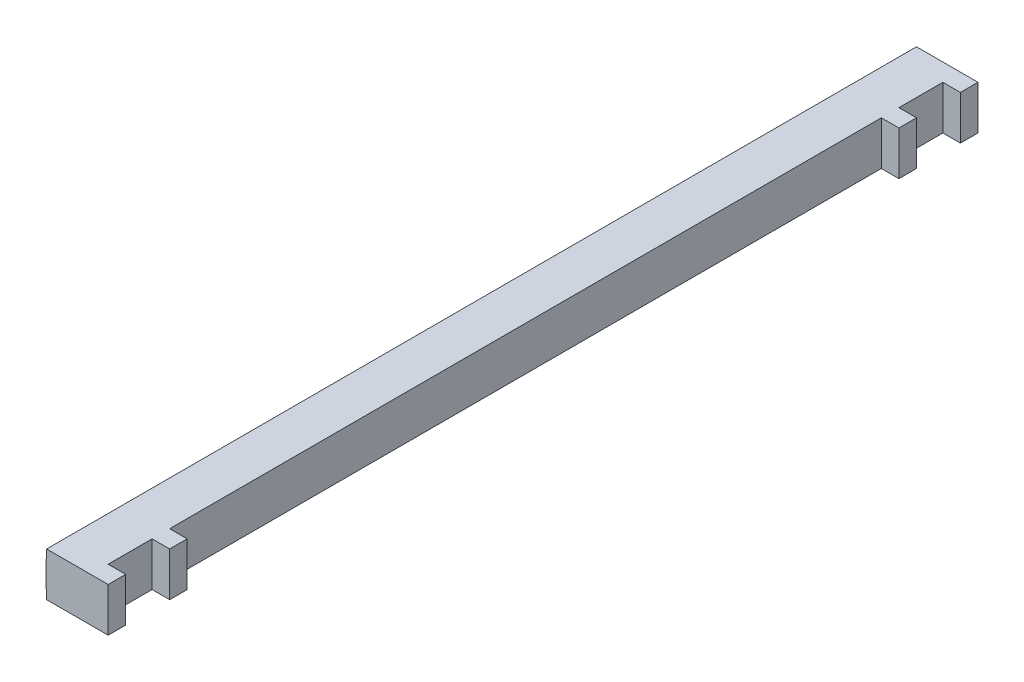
ISO-10303-21;
HEADER;
FILE_DESCRIPTION(('STEP AP214'),'2;1');
FILE_NAME('part.step','',(''),(''),'','','');
FILE_SCHEMA(('AUTOMOTIVE_DESIGN { 1 0 10303 214 1 1 1 1 }'));
ENDSEC;
DATA;
#1=APPLICATION_CONTEXT('core data for automotive mechanical design processes');
#2=APPLICATION_PROTOCOL_DEFINITION('international standard','automotive_design',2000,#1);
#3=PRODUCT_CONTEXT('',#1,'mechanical');
#4=PRODUCT('Part','Part','',(#3));
#5=PRODUCT_RELATED_PRODUCT_CATEGORY('part','',(#4));
#6=PRODUCT_DEFINITION_FORMATION('','',#4);
#7=PRODUCT_DEFINITION_CONTEXT('part definition',#1,'design');
#8=PRODUCT_DEFINITION('design','',#6,#7);
#9=PRODUCT_DEFINITION_SHAPE('','',#8);
#10=(LENGTH_UNIT() NAMED_UNIT(*) SI_UNIT(.MILLI.,.METRE.));
#11=(NAMED_UNIT(*) PLANE_ANGLE_UNIT() SI_UNIT($,.RADIAN.));
#12=(NAMED_UNIT(*) SI_UNIT($,.STERADIAN.) SOLID_ANGLE_UNIT());
#13=UNCERTAINTY_MEASURE_WITH_UNIT(LENGTH_MEASURE(1.E-05),#10,'distance_accuracy_value','');
#14=(GEOMETRIC_REPRESENTATION_CONTEXT(3) GLOBAL_UNCERTAINTY_ASSIGNED_CONTEXT((#13)) GLOBAL_UNIT_ASSIGNED_CONTEXT((#10,
#11,#12)) REPRESENTATION_CONTEXT('',''));
#15=CARTESIAN_POINT('',(0.,0.,0.));
#16=DIRECTION('',(0.,0.,1.));
#17=DIRECTION('',(1.,0.,0.));
#18=AXIS2_PLACEMENT_3D('',#15,#16,#17);
#19=CARTESIAN_POINT('',(-41.169048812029,3.175,173.99));
#20=DIRECTION('',(-1.,0.,0.));
#21=DIRECTION('',(0.,0.,1.));
#22=AXIS2_PLACEMENT_3D('',#19,#20,#21);
#23=PLANE('',#22);
#24=DIRECTION('',(0.,-1.,0.));
#25=VECTOR('',#24,1.);
#26=CARTESIAN_POINT('',(-41.169048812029,3.175,2.54000000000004));
#27=LINE('',#26,#25);
#28=CARTESIAN_POINT('',(-41.169048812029,3.175,2.54000000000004));
#29=VERTEX_POINT('',#28);
#30=CARTESIAN_POINT('',(-41.169048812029,-3.175,2.54000000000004));
#31=VERTEX_POINT('',#30);
#32=EDGE_CURVE('E62',#29,#31,#27,.T.);
#33=ORIENTED_EDGE('',*,*,#32,.F.);
#34=DIRECTION('',(0.,0.,-1.));
#35=VECTOR('',#34,1.);
#36=CARTESIAN_POINT('',(-41.169048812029,3.175,173.99));
#37=LINE('',#36,#35);
#38=CARTESIAN_POINT('',(-41.169048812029,3.175,8.89000000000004));
#39=VERTEX_POINT('',#38);
#40=EDGE_CURVE('E200',#39,#29,#37,.T.);
#41=ORIENTED_EDGE('',*,*,#40,.F.);
#42=DIRECTION('',(0.,1.,0.));
#43=VECTOR('',#42,1.);
#44=CARTESIAN_POINT('',(-41.169048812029,-3.175,8.89000000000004));
#45=LINE('',#44,#43);
#46=CARTESIAN_POINT('',(-41.169048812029,-3.175,8.89000000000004));
#47=VERTEX_POINT('',#46);
#48=EDGE_CURVE('E291',#47,#39,#45,.T.);
#49=ORIENTED_EDGE('',*,*,#48,.F.);
#50=DIRECTION('',(0.,0.,-1.));
#51=VECTOR('',#50,1.);
#52=CARTESIAN_POINT('',(-41.169048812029,-3.175,173.99));
#53=LINE('',#52,#51);
#54=EDGE_CURVE('E58',#47,#31,#53,.T.);
#55=ORIENTED_EDGE('',*,*,#54,.T.);
#56=EDGE_LOOP('',(#33,#41,#49,#55));
#57=FACE_BOUND('',#56,.T.);
#58=ADVANCED_FACE('F42',(#57),#23,.F.);
#59=DIRECTION('',(0.,-1.,0.));
#60=VECTOR('',#59,1.);
#61=CARTESIAN_POINT('',(-41.169048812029,3.175,116.84));
#62=LINE('',#61,#60);
#63=CARTESIAN_POINT('',(-41.169048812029,3.175,116.84));
#64=VERTEX_POINT('',#63);
#65=CARTESIAN_POINT('',(-41.169048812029,-3.175,116.84));
#66=VERTEX_POINT('',#65);
#67=EDGE_CURVE('E216',#64,#66,#62,.T.);
#68=ORIENTED_EDGE('',*,*,#67,.F.);
#69=CARTESIAN_POINT('',(-41.169048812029,3.175,123.19));
#70=VERTEX_POINT('',#69);
#71=EDGE_CURVE('E203',#70,#64,#37,.T.);
#72=ORIENTED_EDGE('',*,*,#71,.F.);
#73=DIRECTION('',(0.,1.,0.));
#74=VECTOR('',#73,1.);
#75=CARTESIAN_POINT('',(-41.169048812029,-3.175,123.19));
#76=LINE('',#75,#74);
#77=CARTESIAN_POINT('',(-41.169048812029,-3.175,123.19));
#78=VERTEX_POINT('',#77);
#79=EDGE_CURVE('E218',#78,#70,#76,.T.);
#80=ORIENTED_EDGE('',*,*,#79,.F.);
#81=EDGE_CURVE('E51',#78,#66,#53,.T.);
#82=ORIENTED_EDGE('',*,*,#81,.T.);
#83=EDGE_LOOP('',(#68,#72,#80,#82));
#84=FACE_BOUND('',#83,.T.);
#85=ADVANCED_FACE('F215',(#84),#23,.F.);
#86=CARTESIAN_POINT('',(-41.169048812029,-3.175,114.3));
#87=VERTEX_POINT('',#86);
#88=CARTESIAN_POINT('',(-41.169048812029,-3.175,11.43));
#89=VERTEX_POINT('',#88);
#90=EDGE_CURVE('E205',#87,#89,#53,.T.);
#91=ORIENTED_EDGE('',*,*,#90,.T.);
#92=DIRECTION('',(0.,1.,0.));
#93=VECTOR('',#92,1.);
#94=CARTESIAN_POINT('',(-41.169048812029,-3.175,11.43));
#95=LINE('',#94,#93);
#96=CARTESIAN_POINT('',(-41.169048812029,3.175,11.43));
#97=VERTEX_POINT('',#96);
#98=EDGE_CURVE('E287',#89,#97,#95,.T.);
#99=ORIENTED_EDGE('',*,*,#98,.T.);
#100=CARTESIAN_POINT('',(-41.169048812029,3.175,114.3));
#101=VERTEX_POINT('',#100);
#102=EDGE_CURVE('E202',#101,#97,#37,.T.);
#103=ORIENTED_EDGE('',*,*,#102,.F.);
#104=DIRECTION('',(0.,-1.,0.));
#105=VECTOR('',#104,1.);
#106=CARTESIAN_POINT('',(-41.169048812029,3.175,114.3));
#107=LINE('',#106,#105);
#108=EDGE_CURVE('E238',#101,#87,#107,.T.);
#109=ORIENTED_EDGE('',*,*,#108,.T.);
#110=EDGE_LOOP('',(#91,#99,#103,#109));
#111=FACE_BOUND('',#110,.T.);
#112=ADVANCED_FACE('F346',(#111),#23,.F.);
#113=CARTESIAN_POINT('',(0.,0.,173.99));
#114=DIRECTION('',(0.,0.,-1.));
#115=DIRECTION('',(-1.,0.,0.));
#116=AXIS2_PLACEMENT_3D('',#113,#114,#115);
#117=CYLINDRICAL_SURFACE('',#116,47.625);
#118=DIRECTION('',(0.,0.,-1.));
#119=VECTOR('',#118,1.);
#120=CARTESIAN_POINT('',(-47.519048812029,-3.175,173.99));
#121=LINE('',#120,#119);
#122=CARTESIAN_POINT('',(-47.519048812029,-3.175,125.73));
#123=VERTEX_POINT('',#122);
#124=CARTESIAN_POINT('',(-47.519048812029,-3.175,0.));
#125=VERTEX_POINT('',#124);
#126=EDGE_CURVE('E11',#123,#125,#121,.T.);
#127=ORIENTED_EDGE('',*,*,#126,.F.);
#128=CARTESIAN_POINT('',(0.,0.,125.73));
#129=DIRECTION('',(0.,0.,-1.));
#130=DIRECTION('',(-1.,0.,0.));
#131=AXIS2_PLACEMENT_3D('',#128,#129,#130);
#132=CIRCLE('',#131,47.625);
#133=CARTESIAN_POINT('',(-47.519048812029,3.175,125.73));
#134=VERTEX_POINT('',#133);
#135=EDGE_CURVE('E170',#123,#134,#132,.T.);
#136=ORIENTED_EDGE('',*,*,#135,.T.);
#137=DIRECTION('',(0.,0.,-1.));
#138=VECTOR('',#137,1.);
#139=CARTESIAN_POINT('',(-47.519048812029,3.175,173.99));
#140=LINE('',#139,#138);
#141=CARTESIAN_POINT('',(-47.519048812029,3.175,0.));
#142=VERTEX_POINT('',#141);
#143=EDGE_CURVE('E180',#134,#142,#140,.T.);
#144=ORIENTED_EDGE('',*,*,#143,.T.);
#145=CARTESIAN_POINT('',(0.,0.,0.));
#146=DIRECTION('',(0.,0.,1.));
#147=DIRECTION('',(1.,0.,0.));
#148=AXIS2_PLACEMENT_3D('',#145,#146,#147);
#149=CIRCLE('',#148,47.625);
#150=EDGE_CURVE('E179',#142,#125,#149,.T.);
#151=ORIENTED_EDGE('',*,*,#150,.T.);
#152=EDGE_LOOP('',(#127,#136,#144,#151));
#153=FACE_BOUND('',#152,.T.);
#154=ADVANCED_FACE('F44',(#153),#117,.T.);
#155=CARTESIAN_POINT('',(-41.169048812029,-3.175,173.99));
#156=DIRECTION('',(0.,1.,0.));
#157=DIRECTION('',(0.,0.,1.));
#158=AXIS2_PLACEMENT_3D('',#155,#156,#157);
#159=PLANE('',#158);
#160=DIRECTION('',(-1.,0.,0.));
#161=VECTOR('',#160,1.);
#162=CARTESIAN_POINT('',(-38.629048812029,-3.175,125.73));
#163=LINE('',#162,#161);
#164=CARTESIAN_POINT('',(-38.629048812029,-3.175,125.73));
#165=VERTEX_POINT('',#164);
#166=EDGE_CURVE('E154',#165,#123,#163,.T.);
#167=ORIENTED_EDGE('',*,*,#166,.T.);
#168=ORIENTED_EDGE('',*,*,#126,.T.);
#169=DIRECTION('',(1.,0.,0.));
#170=VECTOR('',#169,1.);
#171=CARTESIAN_POINT('',(-41.169048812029,-3.175,0.));
#172=LINE('',#171,#170);
#173=CARTESIAN_POINT('',(-38.629048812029,-3.175,0.));
#174=VERTEX_POINT('',#173);
#175=EDGE_CURVE('E184',#125,#174,#172,.T.);
#176=ORIENTED_EDGE('',*,*,#175,.T.);
#177=DIRECTION('',(0.,0.,-1.));
#178=VECTOR('',#177,1.);
#179=CARTESIAN_POINT('',(-38.629048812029,-3.175,2.54000000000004));
#180=LINE('',#179,#178);
#181=CARTESIAN_POINT('',(-38.629048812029,-3.175,2.54000000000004));
#182=VERTEX_POINT('',#181);
#183=EDGE_CURVE('E263',#182,#174,#180,.T.);
#184=ORIENTED_EDGE('',*,*,#183,.F.);
#185=DIRECTION('',(-1.,0.,0.));
#186=VECTOR('',#185,1.);
#187=CARTESIAN_POINT('',(-38.629048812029,-3.175,2.54000000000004));
#188=LINE('',#187,#186);
#189=EDGE_CURVE('E571',#182,#31,#188,.T.);
#190=ORIENTED_EDGE('',*,*,#189,.T.);
#191=ORIENTED_EDGE('',*,*,#54,.F.);
#192=DIRECTION('',(-1.,0.,0.));
#193=VECTOR('',#192,1.);
#194=CARTESIAN_POINT('',(-38.629048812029,-3.175,8.89000000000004));
#195=LINE('',#194,#193);
#196=CARTESIAN_POINT('',(-38.629048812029,-3.175,8.89000000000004));
#197=VERTEX_POINT('',#196);
#198=EDGE_CURVE('E273',#197,#47,#195,.T.);
#199=ORIENTED_EDGE('',*,*,#198,.F.);
#200=DIRECTION('',(0.,0.,-1.));
#201=VECTOR('',#200,1.);
#202=CARTESIAN_POINT('',(-38.629048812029,-3.175,11.43));
#203=LINE('',#202,#201);
#204=CARTESIAN_POINT('',(-38.629048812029,-3.175,11.43));
#205=VERTEX_POINT('',#204);
#206=EDGE_CURVE('E292',#205,#197,#203,.T.);
#207=ORIENTED_EDGE('',*,*,#206,.F.);
#208=DIRECTION('',(-1.,0.,0.));
#209=VECTOR('',#208,1.);
#210=CARTESIAN_POINT('',(-38.629048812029,-3.175,11.43));
#211=LINE('',#210,#209);
#212=EDGE_CURVE('E283',#205,#89,#211,.T.);
#213=ORIENTED_EDGE('',*,*,#212,.T.);
#214=ORIENTED_EDGE('',*,*,#90,.F.);
#215=DIRECTION('',(-1.,0.,0.));
#216=VECTOR('',#215,1.);
#217=CARTESIAN_POINT('',(-38.629048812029,-3.175,114.3));
#218=LINE('',#217,#216);
#219=CARTESIAN_POINT('',(-38.629048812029,-3.175,114.3));
#220=VERTEX_POINT('',#219);
#221=EDGE_CURVE('E295',#220,#87,#218,.T.);
#222=ORIENTED_EDGE('',*,*,#221,.F.);
#223=DIRECTION('',(0.,0.,-1.));
#224=VECTOR('',#223,1.);
#225=CARTESIAN_POINT('',(-38.629048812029,-3.175,116.84));
#226=LINE('',#225,#224);
#227=CARTESIAN_POINT('',(-38.629048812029,-3.175,116.84));
#228=VERTEX_POINT('',#227);
#229=EDGE_CURVE('E241',#228,#220,#226,.T.);
#230=ORIENTED_EDGE('',*,*,#229,.F.);
#231=DIRECTION('',(-1.,0.,0.));
#232=VECTOR('',#231,1.);
#233=CARTESIAN_POINT('',(-38.629048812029,-3.175,116.84));
#234=LINE('',#233,#232);
#235=EDGE_CURVE('E222',#228,#66,#234,.T.);
#236=ORIENTED_EDGE('',*,*,#235,.T.);
#237=ORIENTED_EDGE('',*,*,#81,.F.);
#238=DIRECTION('',(-1.,0.,0.));
#239=VECTOR('',#238,1.);
#240=CARTESIAN_POINT('',(-38.629048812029,-3.175,123.19));
#241=LINE('',#240,#239);
#242=CARTESIAN_POINT('',(-38.629048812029,-3.175,123.19));
#243=VERTEX_POINT('',#242);
#244=EDGE_CURVE('E185',#243,#78,#241,.T.);
#245=ORIENTED_EDGE('',*,*,#244,.F.);
#246=DIRECTION('',(0.,0.,-1.));
#247=VECTOR('',#246,1.);
#248=CARTESIAN_POINT('',(-38.629048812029,-3.175,125.73));
#249=LINE('',#248,#247);
#250=EDGE_CURVE('E161',#165,#243,#249,.T.);
#251=ORIENTED_EDGE('',*,*,#250,.F.);
#252=EDGE_LOOP('',(#167,#168,#176,#184,#190,#191,#199,#207,#213,#214,#222,#230,#236,#237,#245,#251));
#253=FACE_BOUND('',#252,.T.);
#254=ADVANCED_FACE('F156',(#253),#159,.F.);
#255=CARTESIAN_POINT('',(-47.519048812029,3.175,173.99));
#256=DIRECTION('',(0.,-1.,0.));
#257=DIRECTION('',(0.,0.,-1.));
#258=AXIS2_PLACEMENT_3D('',#255,#256,#257);
#259=PLANE('',#258);
#260=ORIENTED_EDGE('',*,*,#143,.F.);
#261=DIRECTION('',(-1.,0.,0.));
#262=VECTOR('',#261,1.);
#263=CARTESIAN_POINT('',(-38.629048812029,3.175,125.73));
#264=LINE('',#263,#262);
#265=CARTESIAN_POINT('',(-38.629048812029,3.175,125.73));
#266=VERTEX_POINT('',#265);
#267=EDGE_CURVE('E166',#266,#134,#264,.T.);
#268=ORIENTED_EDGE('',*,*,#267,.F.);
#269=DIRECTION('',(0.,0.,-1.));
#270=VECTOR('',#269,1.);
#271=CARTESIAN_POINT('',(-38.629048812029,3.175,125.73));
#272=LINE('',#271,#270);
#273=CARTESIAN_POINT('',(-38.629048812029,3.175,123.19));
#274=VERTEX_POINT('',#273);
#275=EDGE_CURVE('E232',#266,#274,#272,.T.);
#276=ORIENTED_EDGE('',*,*,#275,.T.);
#277=DIRECTION('',(-1.,0.,0.));
#278=VECTOR('',#277,1.);
#279=CARTESIAN_POINT('',(-38.629048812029,3.175,123.19));
#280=LINE('',#279,#278);
#281=EDGE_CURVE('E192',#274,#70,#280,.T.);
#282=ORIENTED_EDGE('',*,*,#281,.T.);
#283=ORIENTED_EDGE('',*,*,#71,.T.);
#284=DIRECTION('',(-1.,0.,0.));
#285=VECTOR('',#284,1.);
#286=CARTESIAN_POINT('',(-38.629048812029,3.175,116.84));
#287=LINE('',#286,#285);
#288=CARTESIAN_POINT('',(-38.629048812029,3.175,116.84));
#289=VERTEX_POINT('',#288);
#290=EDGE_CURVE('E315',#289,#64,#287,.T.);
#291=ORIENTED_EDGE('',*,*,#290,.F.);
#292=DIRECTION('',(0.,0.,-1.));
#293=VECTOR('',#292,1.);
#294=CARTESIAN_POINT('',(-38.629048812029,3.175,116.84));
#295=LINE('',#294,#293);
#296=CARTESIAN_POINT('',(-38.629048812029,3.175,114.3));
#297=VERTEX_POINT('',#296);
#298=EDGE_CURVE('E328',#289,#297,#295,.T.);
#299=ORIENTED_EDGE('',*,*,#298,.T.);
#300=DIRECTION('',(-1.,0.,0.));
#301=VECTOR('',#300,1.);
#302=CARTESIAN_POINT('',(-38.629048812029,3.175,114.3));
#303=LINE('',#302,#301);
#304=EDGE_CURVE('E311',#297,#101,#303,.T.);
#305=ORIENTED_EDGE('',*,*,#304,.T.);
#306=ORIENTED_EDGE('',*,*,#102,.T.);
#307=DIRECTION('',(-1.,0.,0.));
#308=VECTOR('',#307,1.);
#309=CARTESIAN_POINT('',(-38.629048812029,3.175,11.43));
#310=LINE('',#309,#308);
#311=CARTESIAN_POINT('',(-38.629048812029,3.175,11.43));
#312=VERTEX_POINT('',#311);
#313=EDGE_CURVE('E280',#312,#97,#310,.T.);
#314=ORIENTED_EDGE('',*,*,#313,.F.);
#315=DIRECTION('',(0.,0.,-1.));
#316=VECTOR('',#315,1.);
#317=CARTESIAN_POINT('',(-38.629048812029,3.175,11.43));
#318=LINE('',#317,#316);
#319=CARTESIAN_POINT('',(-38.629048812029,3.175,8.89000000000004));
#320=VERTEX_POINT('',#319);
#321=EDGE_CURVE('E299',#312,#320,#318,.T.);
#322=ORIENTED_EDGE('',*,*,#321,.T.);
#323=DIRECTION('',(-1.,0.,0.));
#324=VECTOR('',#323,1.);
#325=CARTESIAN_POINT('',(-38.629048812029,3.175,8.89000000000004));
#326=LINE('',#325,#324);
#327=EDGE_CURVE('E276',#320,#39,#326,.T.);
#328=ORIENTED_EDGE('',*,*,#327,.T.);
#329=ORIENTED_EDGE('',*,*,#40,.T.);
#330=DIRECTION('',(-1.,0.,0.));
#331=VECTOR('',#330,1.);
#332=CARTESIAN_POINT('',(-38.629048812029,3.175,2.54000000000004));
#333=LINE('',#332,#331);
#334=CARTESIAN_POINT('',(-38.629048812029,3.175,2.54000000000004));
#335=VERTEX_POINT('',#334);
#336=EDGE_CURVE('E175',#335,#29,#333,.T.);
#337=ORIENTED_EDGE('',*,*,#336,.F.);
#338=DIRECTION('',(0.,0.,-1.));
#339=VECTOR('',#338,1.);
#340=CARTESIAN_POINT('',(-38.629048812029,3.175,2.54000000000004));
#341=LINE('',#340,#339);
#342=CARTESIAN_POINT('',(-38.629048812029,3.175,0.));
#343=VERTEX_POINT('',#342);
#344=EDGE_CURVE('E254',#335,#343,#341,.T.);
#345=ORIENTED_EDGE('',*,*,#344,.T.);
#346=DIRECTION('',(-1.,0.,0.));
#347=VECTOR('',#346,1.);
#348=CARTESIAN_POINT('',(-47.519048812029,3.175,0.));
#349=LINE('',#348,#347);
#350=EDGE_CURVE('E189',#343,#142,#349,.T.);
#351=ORIENTED_EDGE('',*,*,#350,.T.);
#352=EDGE_LOOP('',(#260,#268,#276,#282,#283,#291,#299,#305,#306,#314,#322,#328,#329,#337,#345,#351));
#353=FACE_BOUND('',#352,.T.);
#354=ADVANCED_FACE('F251',(#353),#259,.F.);
#355=CARTESIAN_POINT('',(0.,0.,0.));
#356=DIRECTION('',(0.,0.,1.));
#357=DIRECTION('',(1.,0.,0.));
#358=AXIS2_PLACEMENT_3D('',#355,#356,#357);
#359=PLANE('',#358);
#360=ORIENTED_EDGE('',*,*,#150,.F.);
#361=ORIENTED_EDGE('',*,*,#350,.F.);
#362=DIRECTION('',(0.,-1.,0.));
#363=VECTOR('',#362,1.);
#364=CARTESIAN_POINT('',(-38.629048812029,3.175,0.));
#365=LINE('',#364,#363);
#366=EDGE_CURVE('E258',#343,#174,#365,.T.);
#367=ORIENTED_EDGE('',*,*,#366,.T.);
#368=ORIENTED_EDGE('',*,*,#175,.F.);
#369=EDGE_LOOP('',(#360,#361,#367,#368));
#370=FACE_BOUND('',#369,.T.);
#371=ADVANCED_FACE('F257',(#370),#359,.F.);
#372=CARTESIAN_POINT('',(-38.629048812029,-3.175,123.19));
#373=DIRECTION('',(0.,0.,1.));
#374=DIRECTION('',(1.,0.,0.));
#375=AXIS2_PLACEMENT_3D('',#372,#373,#374);
#376=PLANE('',#375);
#377=ORIENTED_EDGE('',*,*,#79,.T.);
#378=ORIENTED_EDGE('',*,*,#281,.F.);
#379=DIRECTION('',(0.,1.,0.));
#380=VECTOR('',#379,1.);
#381=CARTESIAN_POINT('',(-38.629048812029,-3.175,123.19));
#382=LINE('',#381,#380);
#383=EDGE_CURVE('E226',#243,#274,#382,.T.);
#384=ORIENTED_EDGE('',*,*,#383,.F.);
#385=ORIENTED_EDGE('',*,*,#244,.T.);
#386=EDGE_LOOP('',(#377,#378,#384,#385));
#387=FACE_BOUND('',#386,.T.);
#388=ADVANCED_FACE('F224',(#387),#376,.F.);
#389=CARTESIAN_POINT('',(-38.629048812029,-3.175,125.73));
#390=DIRECTION('',(0.,0.,1.));
#391=DIRECTION('',(1.,0.,0.));
#392=AXIS2_PLACEMENT_3D('',#389,#390,#391);
#393=PLANE('',#392);
#394=ORIENTED_EDGE('',*,*,#267,.T.);
#395=ORIENTED_EDGE('',*,*,#135,.F.);
#396=ORIENTED_EDGE('',*,*,#166,.F.);
#397=DIRECTION('',(0.,1.,0.));
#398=VECTOR('',#397,1.);
#399=CARTESIAN_POINT('',(-38.629048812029,-3.175,125.73));
#400=LINE('',#399,#398);
#401=EDGE_CURVE('E167',#165,#266,#400,.T.);
#402=ORIENTED_EDGE('',*,*,#401,.T.);
#403=EDGE_LOOP('',(#394,#395,#396,#402));
#404=FACE_BOUND('',#403,.T.);
#405=ADVANCED_FACE('F171',(#404),#393,.T.);
#406=CARTESIAN_POINT('',(-38.629048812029,0.,0.));
#407=DIRECTION('',(1.,0.,0.));
#408=DIRECTION('',(0.,0.,-1.));
#409=AXIS2_PLACEMENT_3D('',#406,#407,#408);
#410=PLANE('',#409);
#411=ORIENTED_EDGE('',*,*,#250,.T.);
#412=ORIENTED_EDGE('',*,*,#383,.T.);
#413=ORIENTED_EDGE('',*,*,#275,.F.);
#414=ORIENTED_EDGE('',*,*,#401,.F.);
#415=EDGE_LOOP('',(#411,#412,#413,#414));
#416=FACE_BOUND('',#415,.T.);
#417=ADVANCED_FACE('F234',(#416),#410,.T.);
#418=CARTESIAN_POINT('',(-38.629048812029,3.175,114.3));
#419=DIRECTION('',(0.,0.,-1.));
#420=DIRECTION('',(-1.,0.,0.));
#421=AXIS2_PLACEMENT_3D('',#418,#419,#420);
#422=PLANE('',#421);
#423=ORIENTED_EDGE('',*,*,#108,.F.);
#424=ORIENTED_EDGE('',*,*,#304,.F.);
#425=DIRECTION('',(0.,-1.,0.));
#426=VECTOR('',#425,1.);
#427=CARTESIAN_POINT('',(-38.629048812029,3.175,114.3));
#428=LINE('',#427,#426);
#429=EDGE_CURVE('E331',#297,#220,#428,.T.);
#430=ORIENTED_EDGE('',*,*,#429,.T.);
#431=ORIENTED_EDGE('',*,*,#221,.T.);
#432=EDGE_LOOP('',(#423,#424,#430,#431));
#433=FACE_BOUND('',#432,.T.);
#434=ADVANCED_FACE('F343',(#433),#422,.T.);
#435=CARTESIAN_POINT('',(-38.629048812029,3.175,116.84));
#436=DIRECTION('',(0.,0.,-1.));
#437=DIRECTION('',(-1.,0.,0.));
#438=AXIS2_PLACEMENT_3D('',#435,#436,#437);
#439=PLANE('',#438);
#440=ORIENTED_EDGE('',*,*,#67,.T.);
#441=ORIENTED_EDGE('',*,*,#235,.F.);
#442=DIRECTION('',(0.,-1.,0.));
#443=VECTOR('',#442,1.);
#444=CARTESIAN_POINT('',(-38.629048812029,3.175,116.84));
#445=LINE('',#444,#443);
#446=EDGE_CURVE('E320',#289,#228,#445,.T.);
#447=ORIENTED_EDGE('',*,*,#446,.F.);
#448=ORIENTED_EDGE('',*,*,#290,.T.);
#449=EDGE_LOOP('',(#440,#441,#447,#448));
#450=FACE_BOUND('',#449,.T.);
#451=ADVANCED_FACE('F352',(#450),#439,.F.);
#452=CARTESIAN_POINT('',(-38.629048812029,0.,0.));
#453=DIRECTION('',(-1.,0.,0.));
#454=DIRECTION('',(0.,0.,1.));
#455=AXIS2_PLACEMENT_3D('',#452,#453,#454);
#456=PLANE('',#455);
#457=ORIENTED_EDGE('',*,*,#229,.T.);
#458=ORIENTED_EDGE('',*,*,#429,.F.);
#459=ORIENTED_EDGE('',*,*,#298,.F.);
#460=ORIENTED_EDGE('',*,*,#446,.T.);
#461=EDGE_LOOP('',(#457,#458,#459,#460));
#462=FACE_BOUND('',#461,.T.);
#463=ADVANCED_FACE('F339',(#462),#456,.F.);
#464=CARTESIAN_POINT('',(-38.629048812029,-3.175,8.89000000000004));
#465=DIRECTION('',(0.,0.,1.));
#466=DIRECTION('',(1.,0.,0.));
#467=AXIS2_PLACEMENT_3D('',#464,#465,#466);
#468=PLANE('',#467);
#469=ORIENTED_EDGE('',*,*,#48,.T.);
#470=ORIENTED_EDGE('',*,*,#327,.F.);
#471=DIRECTION('',(0.,1.,0.));
#472=VECTOR('',#471,1.);
#473=CARTESIAN_POINT('',(-38.629048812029,-3.175,8.89000000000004));
#474=LINE('',#473,#472);
#475=EDGE_CURVE('E303',#197,#320,#474,.T.);
#476=ORIENTED_EDGE('',*,*,#475,.F.);
#477=ORIENTED_EDGE('',*,*,#198,.T.);
#478=EDGE_LOOP('',(#469,#470,#476,#477));
#479=FACE_BOUND('',#478,.T.);
#480=ADVANCED_FACE('F359',(#479),#468,.F.);
#481=CARTESIAN_POINT('',(-38.629048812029,-3.175,11.43));
#482=DIRECTION('',(0.,0.,1.));
#483=DIRECTION('',(1.,0.,0.));
#484=AXIS2_PLACEMENT_3D('',#481,#482,#483);
#485=PLANE('',#484);
#486=ORIENTED_EDGE('',*,*,#98,.F.);
#487=ORIENTED_EDGE('',*,*,#212,.F.);
#488=DIRECTION('',(0.,1.,0.));
#489=VECTOR('',#488,1.);
#490=CARTESIAN_POINT('',(-38.629048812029,-3.175,11.43));
#491=LINE('',#490,#489);
#492=EDGE_CURVE('E286',#205,#312,#491,.T.);
#493=ORIENTED_EDGE('',*,*,#492,.T.);
#494=ORIENTED_EDGE('',*,*,#313,.T.);
#495=EDGE_LOOP('',(#486,#487,#493,#494));
#496=FACE_BOUND('',#495,.T.);
#497=ADVANCED_FACE('F419',(#496),#485,.T.);
#498=CARTESIAN_POINT('',(-38.629048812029,0.,0.));
#499=DIRECTION('',(1.,0.,0.));
#500=DIRECTION('',(0.,0.,-1.));
#501=AXIS2_PLACEMENT_3D('',#498,#499,#500);
#502=PLANE('',#501);
#503=ORIENTED_EDGE('',*,*,#206,.T.);
#504=ORIENTED_EDGE('',*,*,#475,.T.);
#505=ORIENTED_EDGE('',*,*,#321,.F.);
#506=ORIENTED_EDGE('',*,*,#492,.F.);
#507=EDGE_LOOP('',(#503,#504,#505,#506));
#508=FACE_BOUND('',#507,.T.);
#509=ADVANCED_FACE('F430',(#508),#502,.T.);
#510=CARTESIAN_POINT('',(-38.629048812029,3.175,2.54000000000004));
#511=DIRECTION('',(0.,0.,-1.));
#512=DIRECTION('',(-1.,0.,0.));
#513=AXIS2_PLACEMENT_3D('',#510,#511,#512);
#514=PLANE('',#513);
#515=ORIENTED_EDGE('',*,*,#32,.T.);
#516=ORIENTED_EDGE('',*,*,#189,.F.);
#517=DIRECTION('',(0.,-1.,0.));
#518=VECTOR('',#517,1.);
#519=CARTESIAN_POINT('',(-38.629048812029,3.175,2.54000000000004));
#520=LINE('',#519,#518);
#521=EDGE_CURVE('E269',#335,#182,#520,.T.);
#522=ORIENTED_EDGE('',*,*,#521,.F.);
#523=ORIENTED_EDGE('',*,*,#336,.T.);
#524=EDGE_LOOP('',(#515,#516,#522,#523));
#525=FACE_BOUND('',#524,.T.);
#526=ADVANCED_FACE('F441',(#525),#514,.F.);
#527=CARTESIAN_POINT('',(-38.629048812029,0.,0.));
#528=DIRECTION('',(-1.,0.,0.));
#529=DIRECTION('',(0.,0.,1.));
#530=AXIS2_PLACEMENT_3D('',#527,#528,#529);
#531=PLANE('',#530);
#532=ORIENTED_EDGE('',*,*,#344,.F.);
#533=ORIENTED_EDGE('',*,*,#521,.T.);
#534=ORIENTED_EDGE('',*,*,#183,.T.);
#535=ORIENTED_EDGE('',*,*,#366,.F.);
#536=EDGE_LOOP('',(#532,#533,#534,#535));
#537=FACE_BOUND('',#536,.T.);
#538=ADVANCED_FACE('F261',(#537),#531,.F.);
#539=CLOSED_SHELL('',(#58,#85,#112,#154,#254,#354,#371,#388,#405,#417,#434,#451,#463,#480,#497,
#509,#526,#538));
#540=MANIFOLD_SOLID_BREP('B2',#539);
#541=ADVANCED_BREP_SHAPE_REPRESENTATION('',(#18,#540),#14);
#542=SHAPE_DEFINITION_REPRESENTATION(#9,#541);
ENDSEC;
END-ISO-10303-21;
